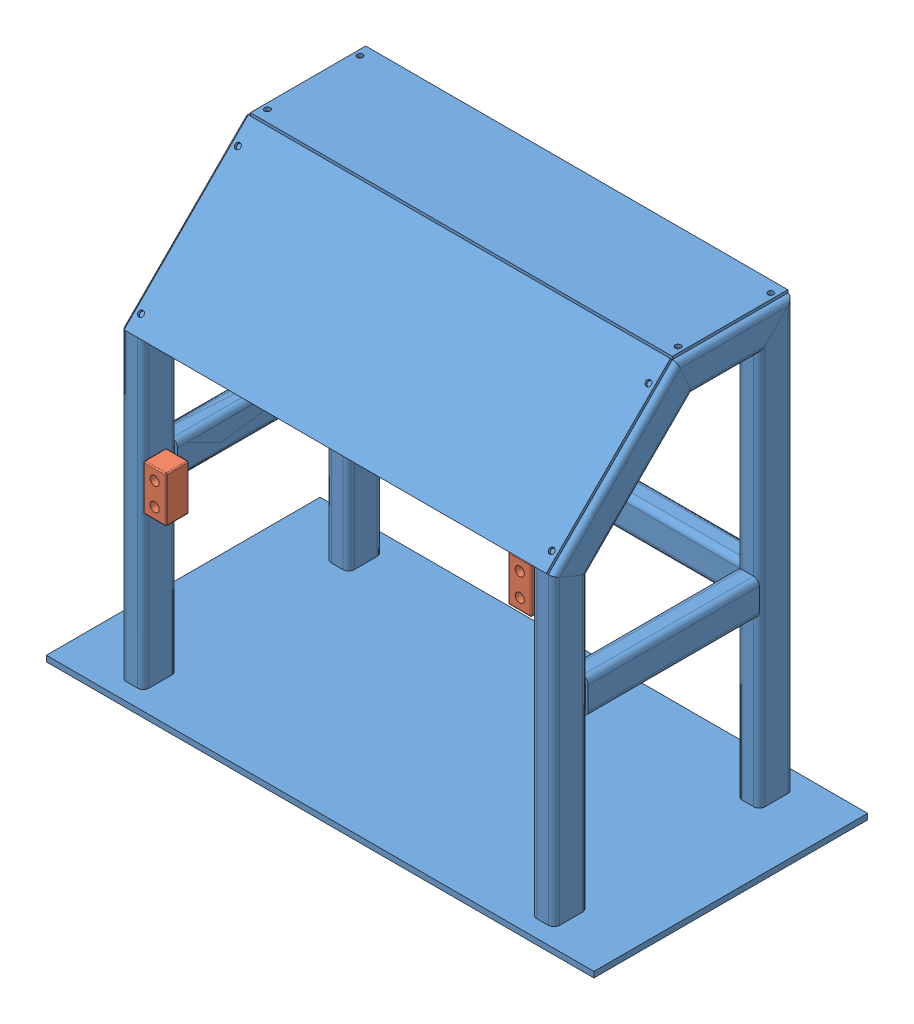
SolidWorks assembly PipingStructure1.SLDASM, configuration Default (file format 3400). Lengths in mm.
Overall size (1219.2 971.55 609.6).
3 component instances, 2 part files, 6 mates.
Components (placement in the parent):
- Structure2-1: Structure2.SLDPRT [Default<As Machined>] at origin size (1219.2 971.55 609.6)
- Pipe Terminal-1: Pipe Terminal.SLDPRT [1] at (406.4 638.0815 215.9) x (0 0 1) z (-1 0 0) size (50.8 101.6 50.8)
- Pipe Terminal-2: Pipe Terminal.SLDPRT [3] at (-406.4 406.4 215.9) x (0 0 1) z (-1 0 0) size (50.8 101.6 50.8)
Mates (geometry in assembly coordinates):
- Coincident4: coincident: line of Structure2-1
- Coincident5: coincident anti-aligned: unknown of Structure2-1
- Coincident6: coincident aligned: unknown of Structure2-1
- Coincident10: coincident aligned: plane of Structure2-1 through (-444.5 12.7 266.7) normal (0 0 1); plane of Pipe Terminal-2 through (-431.8 457.2 266.7) normal (0 0 1)
- Coincident8: coincident anti-aligned: plane of Structure2-1 through (-431.8 12.7 254) normal (1 0 0); plane of Pipe Terminal-2 through (-431.8 457.2 266.7) normal (-1 0 0)
- Coincident9: coincident aligned: plane of Structure2-1 through (-469.9 457.2 -228.6) normal (0 1 0); plane of Pipe Terminal-2 through (-431.8 457.2 266.7) normal (0 1 0)
